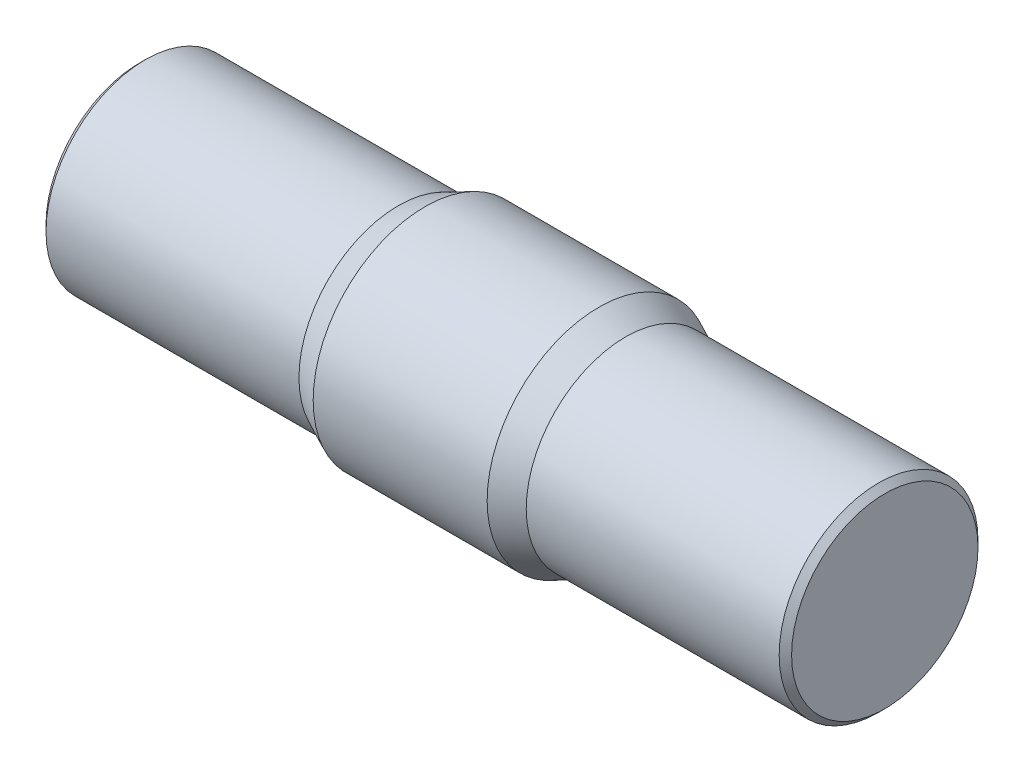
ISO-10303-21;
HEADER;
FILE_DESCRIPTION(('STEP AP214'),'2;1');
FILE_NAME('part.step','',(''),(''),'','','');
FILE_SCHEMA(('AUTOMOTIVE_DESIGN { 1 0 10303 214 1 1 1 1 }'));
ENDSEC;
DATA;
#1=APPLICATION_CONTEXT('core data for automotive mechanical design processes');
#2=APPLICATION_PROTOCOL_DEFINITION('international standard','automotive_design',2000,#1);
#3=PRODUCT_CONTEXT('',#1,'mechanical');
#4=PRODUCT('Part','Part','',(#3));
#5=PRODUCT_RELATED_PRODUCT_CATEGORY('part','',(#4));
#6=PRODUCT_DEFINITION_FORMATION('','',#4);
#7=PRODUCT_DEFINITION_CONTEXT('part definition',#1,'design');
#8=PRODUCT_DEFINITION('design','',#6,#7);
#9=PRODUCT_DEFINITION_SHAPE('','',#8);
#10=(LENGTH_UNIT() NAMED_UNIT(*) SI_UNIT(.MILLI.,.METRE.));
#11=(NAMED_UNIT(*) PLANE_ANGLE_UNIT() SI_UNIT($,.RADIAN.));
#12=(NAMED_UNIT(*) SI_UNIT($,.STERADIAN.) SOLID_ANGLE_UNIT());
#13=UNCERTAINTY_MEASURE_WITH_UNIT(LENGTH_MEASURE(1.E-05),#10,'distance_accuracy_value','');
#14=(GEOMETRIC_REPRESENTATION_CONTEXT(3) GLOBAL_UNCERTAINTY_ASSIGNED_CONTEXT((#13)) GLOBAL_UNIT_ASSIGNED_CONTEXT((#10,
#11,#12)) REPRESENTATION_CONTEXT('',''));
#15=CARTESIAN_POINT('',(0.,0.,0.));
#16=DIRECTION('',(0.,0.,1.));
#17=DIRECTION('',(1.,0.,0.));
#18=AXIS2_PLACEMENT_3D('',#15,#16,#17);
#19=CARTESIAN_POINT('',(0.,0.,0.));
#20=DIRECTION('',(1.,0.,0.));
#21=DIRECTION('',(0.,0.,-1.));
#22=AXIS2_PLACEMENT_3D('',#19,#20,#21);
#23=PLANE('',#22);
#24=CARTESIAN_POINT('',(0.,0.,0.));
#25=DIRECTION('',(1.,0.,0.));
#26=DIRECTION('',(0.,0.,-1.));
#27=AXIS2_PLACEMENT_3D('',#24,#25,#26);
#28=CIRCLE('',#27,7.50000000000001);
#29=CARTESIAN_POINT('',(0.,0.,-7.50000000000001));
#30=VERTEX_POINT('',#29);
#31=EDGE_CURVE('E37',#30,#30,#28,.F.);
#32=ORIENTED_EDGE('',*,*,#31,.T.);
#33=EDGE_LOOP('',(#32));
#34=FACE_BOUND('',#33,.T.);
#35=ADVANCED_FACE('F30',(#34),#23,.F.);
#36=CARTESIAN_POINT('',(0.,0.,0.));
#37=DIRECTION('',(-1.,0.,0.));
#38=DIRECTION('',(0.,0.,1.));
#39=AXIS2_PLACEMENT_3D('',#36,#37,#38);
#40=CYLINDRICAL_SURFACE('',#39,8.);
#41=CARTESIAN_POINT('',(0.499999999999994,0.,0.));
#42=DIRECTION('',(1.,0.,0.));
#43=DIRECTION('',(0.,0.,-1.));
#44=AXIS2_PLACEMENT_3D('',#41,#42,#43);
#45=CIRCLE('',#44,8.);
#46=CARTESIAN_POINT('',(0.499999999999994,0.,-8.));
#47=VERTEX_POINT('',#46);
#48=EDGE_CURVE('E10',#47,#47,#45,.T.);
#49=ORIENTED_EDGE('',*,*,#48,.T.);
#50=EDGE_LOOP('',(#49));
#51=FACE_BOUND('',#50,.T.);
#52=CARTESIAN_POINT('',(20.8554930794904,0.,0.));
#53=DIRECTION('',(-1.,0.,0.));
#54=DIRECTION('',(0.,0.,1.));
#55=AXIS2_PLACEMENT_3D('',#52,#53,#54);
#56=CIRCLE('',#55,8.);
#57=CARTESIAN_POINT('',(20.8554930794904,0.,8.));
#58=VERTEX_POINT('',#57);
#59=EDGE_CURVE('E50',#58,#58,#56,.T.);
#60=ORIENTED_EDGE('',*,*,#59,.T.);
#61=EDGE_LOOP('',(#60));
#62=FACE_BOUND('',#61,.T.);
#63=ADVANCED_FACE('F81',(#51,#62),#40,.T.);
#64=CARTESIAN_POINT('',(23.,0.,0.));
#65=DIRECTION('',(1.,0.,0.));
#66=DIRECTION('',(0.,0.,-1.));
#67=AXIS2_PLACEMENT_3D('',#64,#65,#66);
#68=CONICAL_SURFACE('',#67,9.,0.436332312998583);
#69=ORIENTED_EDGE('',*,*,#59,.F.);
#70=EDGE_LOOP('',(#69));
#71=FACE_BOUND('',#70,.T.);
#72=CARTESIAN_POINT('',(23.,0.,0.));
#73=DIRECTION('',(-1.,0.,0.));
#74=DIRECTION('',(0.,0.,1.));
#75=AXIS2_PLACEMENT_3D('',#72,#73,#74);
#76=CIRCLE('',#75,9.);
#77=CARTESIAN_POINT('',(23.,0.,9.));
#78=VERTEX_POINT('',#77);
#79=EDGE_CURVE('E53',#78,#78,#76,.T.);
#80=ORIENTED_EDGE('',*,*,#79,.T.);
#81=EDGE_LOOP('',(#80));
#82=FACE_BOUND('',#81,.T.);
#83=ADVANCED_FACE('F86',(#71,#82),#68,.T.);
#84=CARTESIAN_POINT('',(0.,0.,0.));
#85=DIRECTION('',(-1.,0.,0.));
#86=DIRECTION('',(0.,0.,1.));
#87=AXIS2_PLACEMENT_3D('',#84,#85,#86);
#88=CYLINDRICAL_SURFACE('',#87,9.);
#89=ORIENTED_EDGE('',*,*,#79,.F.);
#90=EDGE_LOOP('',(#89));
#91=FACE_BOUND('',#90,.T.);
#92=CARTESIAN_POINT('',(37.,0.,0.));
#93=DIRECTION('',(-1.,0.,0.));
#94=DIRECTION('',(0.,0.,1.));
#95=AXIS2_PLACEMENT_3D('',#92,#93,#94);
#96=CIRCLE('',#95,9.);
#97=CARTESIAN_POINT('',(37.,0.,9.));
#98=VERTEX_POINT('',#97);
#99=EDGE_CURVE('E56',#98,#98,#96,.T.);
#100=ORIENTED_EDGE('',*,*,#99,.T.);
#101=EDGE_LOOP('',(#100));
#102=FACE_BOUND('',#101,.T.);
#103=ADVANCED_FACE('F77',(#91,#102),#88,.T.);
#104=CARTESIAN_POINT('',(39.1445069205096,0.,0.));
#105=DIRECTION('',(-1.,0.,0.));
#106=DIRECTION('',(0.,0.,1.));
#107=AXIS2_PLACEMENT_3D('',#104,#105,#106);
#108=CONICAL_SURFACE('',#107,8.,0.436332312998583);
#109=ORIENTED_EDGE('',*,*,#99,.F.);
#110=EDGE_LOOP('',(#109));
#111=FACE_BOUND('',#110,.T.);
#112=CARTESIAN_POINT('',(39.1445069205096,0.,0.));
#113=DIRECTION('',(-1.,0.,0.));
#114=DIRECTION('',(0.,0.,1.));
#115=AXIS2_PLACEMENT_3D('',#112,#113,#114);
#116=CIRCLE('',#115,8.);
#117=CARTESIAN_POINT('',(39.1445069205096,0.,8.));
#118=VERTEX_POINT('',#117);
#119=EDGE_CURVE('E59',#118,#118,#116,.T.);
#120=ORIENTED_EDGE('',*,*,#119,.T.);
#121=EDGE_LOOP('',(#120));
#122=FACE_BOUND('',#121,.T.);
#123=ADVANCED_FACE('F63',(#111,#122),#108,.T.);
#124=CARTESIAN_POINT('',(0.,0.,0.));
#125=DIRECTION('',(-1.,0.,0.));
#126=DIRECTION('',(0.,0.,1.));
#127=AXIS2_PLACEMENT_3D('',#124,#125,#126);
#128=CYLINDRICAL_SURFACE('',#127,8.);
#129=CARTESIAN_POINT('',(59.5,0.,0.));
#130=DIRECTION('',(-1.,0.,0.));
#131=DIRECTION('',(0.,0.,1.));
#132=AXIS2_PLACEMENT_3D('',#129,#130,#131);
#133=CIRCLE('',#132,8.);
#134=CARTESIAN_POINT('',(59.5,0.,8.));
#135=VERTEX_POINT('',#134);
#136=EDGE_CURVE('E45',#135,#135,#133,.T.);
#137=ORIENTED_EDGE('',*,*,#136,.T.);
#138=EDGE_LOOP('',(#137));
#139=FACE_BOUND('',#138,.T.);
#140=ORIENTED_EDGE('',*,*,#119,.F.);
#141=EDGE_LOOP('',(#140));
#142=FACE_BOUND('',#141,.T.);
#143=ADVANCED_FACE('F65',(#139,#142),#128,.T.);
#144=CARTESIAN_POINT('',(60.,8.,0.));
#145=DIRECTION('',(-1.,0.,0.));
#146=DIRECTION('',(0.,0.,1.));
#147=AXIS2_PLACEMENT_3D('',#144,#145,#146);
#148=PLANE('',#147);
#149=CARTESIAN_POINT('',(60.,0.,0.));
#150=DIRECTION('',(-1.,0.,0.));
#151=DIRECTION('',(0.,0.,1.));
#152=AXIS2_PLACEMENT_3D('',#149,#150,#151);
#153=CIRCLE('',#152,7.5);
#154=CARTESIAN_POINT('',(60.,0.,7.5));
#155=VERTEX_POINT('',#154);
#156=EDGE_CURVE('E41',#155,#155,#153,.F.);
#157=ORIENTED_EDGE('',*,*,#156,.T.);
#158=EDGE_LOOP('',(#157));
#159=FACE_BOUND('',#158,.T.);
#160=ADVANCED_FACE('F67',(#159),#148,.F.);
#161=CARTESIAN_POINT('',(59.5,0.,0.));
#162=DIRECTION('',(-1.,0.,0.));
#163=DIRECTION('',(0.,0.,1.));
#164=AXIS2_PLACEMENT_3D('',#161,#162,#163);
#165=CONICAL_SURFACE('',#164,8.,0.785398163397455);
#166=ORIENTED_EDGE('',*,*,#156,.F.);
#167=EDGE_LOOP('',(#166));
#168=FACE_BOUND('',#167,.T.);
#169=ORIENTED_EDGE('',*,*,#136,.F.);
#170=EDGE_LOOP('',(#169));
#171=FACE_BOUND('',#170,.T.);
#172=ADVANCED_FACE('F74',(#168,#171),#165,.T.);
#173=CARTESIAN_POINT('',(0.,0.,0.));
#174=DIRECTION('',(1.,0.,0.));
#175=DIRECTION('',(0.,0.,-1.));
#176=AXIS2_PLACEMENT_3D('',#173,#174,#175);
#177=CONICAL_SURFACE('',#176,7.50000000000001,0.785398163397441);
#178=ORIENTED_EDGE('',*,*,#48,.F.);
#179=EDGE_LOOP('',(#178));
#180=FACE_BOUND('',#179,.T.);
#181=ORIENTED_EDGE('',*,*,#31,.F.);
#182=EDGE_LOOP('',(#181));
#183=FACE_BOUND('',#182,.T.);
#184=ADVANCED_FACE('F32',(#180,#183),#177,.T.);
#185=CLOSED_SHELL('',(#35,#63,#83,#103,#123,#143,#160,#172,#184));
#186=MANIFOLD_SOLID_BREP('B2',#185);
#187=ADVANCED_BREP_SHAPE_REPRESENTATION('',(#18,#186),#14);
#188=SHAPE_DEFINITION_REPRESENTATION(#9,#187);
ENDSEC;
END-ISO-10303-21;
